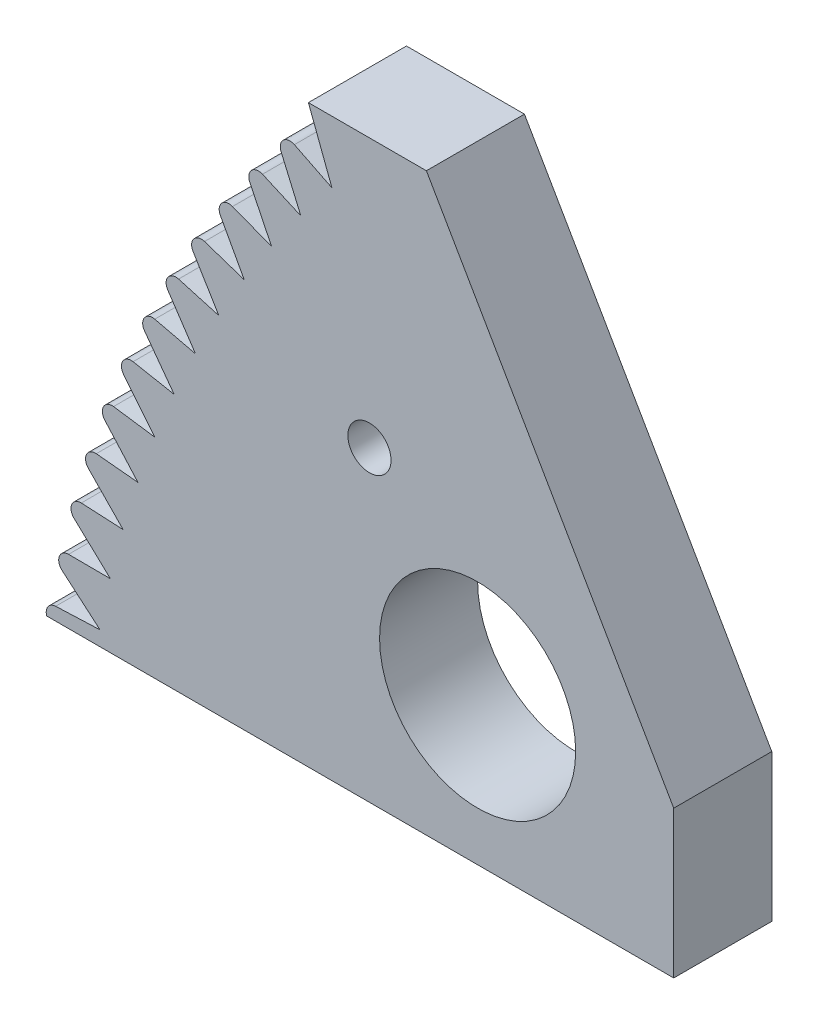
ISO-10303-21;
HEADER;
FILE_DESCRIPTION(('STEP AP214'),'2;1');
FILE_NAME('part.step','',(''),(''),'','','');
FILE_SCHEMA(('AUTOMOTIVE_DESIGN { 1 0 10303 214 1 1 1 1 }'));
ENDSEC;
DATA;
#1=APPLICATION_CONTEXT('core data for automotive mechanical design processes');
#2=APPLICATION_PROTOCOL_DEFINITION('international standard','automotive_design',2000,#1);
#3=PRODUCT_CONTEXT('',#1,'mechanical');
#4=PRODUCT('Part','Part','',(#3));
#5=PRODUCT_RELATED_PRODUCT_CATEGORY('part','',(#4));
#6=PRODUCT_DEFINITION_FORMATION('','',#4);
#7=PRODUCT_DEFINITION_CONTEXT('part definition',#1,'design');
#8=PRODUCT_DEFINITION('design','',#6,#7);
#9=PRODUCT_DEFINITION_SHAPE('','',#8);
#10=(LENGTH_UNIT() NAMED_UNIT(*) SI_UNIT(.MILLI.,.METRE.));
#11=(NAMED_UNIT(*) PLANE_ANGLE_UNIT() SI_UNIT($,.RADIAN.));
#12=(NAMED_UNIT(*) SI_UNIT($,.STERADIAN.) SOLID_ANGLE_UNIT());
#13=UNCERTAINTY_MEASURE_WITH_UNIT(LENGTH_MEASURE(1.E-05),#10,'distance_accuracy_value','');
#14=(GEOMETRIC_REPRESENTATION_CONTEXT(3) GLOBAL_UNCERTAINTY_ASSIGNED_CONTEXT((#13)) GLOBAL_UNIT_ASSIGNED_CONTEXT((#10,
#11,#12)) REPRESENTATION_CONTEXT('',''));
#15=CARTESIAN_POINT('',(0.,0.,0.));
#16=DIRECTION('',(0.,0.,1.));
#17=DIRECTION('',(1.,0.,0.));
#18=AXIS2_PLACEMENT_3D('',#15,#16,#17);
#19=CARTESIAN_POINT('',(-80.9362544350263,37.2735356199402,10.));
#20=DIRECTION('',(0.,0.,-1.));
#21=DIRECTION('',(-1.,0.,0.));
#22=AXIS2_PLACEMENT_3D('',#19,#20,#21);
#23=PLANE('',#22);
#24=CARTESIAN_POINT('',(-111.969374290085,9.89423995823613,10.));
#25=DIRECTION('',(0.,0.,-1.));
#26=DIRECTION('',(0.,1.,0.));
#27=AXIS2_PLACEMENT_3D('',#24,#25,#26);
#28=CIRCLE('',#27,2.2);
#29=CARTESIAN_POINT('',(-111.969374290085,12.0942399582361,10.));
#30=VERTEX_POINT('',#29);
#31=EDGE_CURVE('E1356',#30,#30,#28,.T.);
#32=ORIENTED_EDGE('',*,*,#31,.T.);
#33=EDGE_LOOP('',(#32));
#34=FACE_BOUND('',#33,.T.);
#35=DIRECTION('',(-0.999180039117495,-0.0404876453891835,0.));
#36=VECTOR('',#35,1.);
#37=CARTESIAN_POINT('',(-139.448047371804,-19.9190594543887,10.));
#38=LINE('',#37,#36);
#39=CARTESIAN_POINT('',(-139.448047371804,-19.9190594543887,10.));
#40=VERTEX_POINT('',#39);
#41=CARTESIAN_POINT('',(-143.976101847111,-20.1025401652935,10.));
#42=VERTEX_POINT('',#41);
#43=EDGE_CURVE('E767',#40,#42,#38,.T.);
#44=ORIENTED_EDGE('',*,*,#43,.T.);
#45=CARTESIAN_POINT('',(-143.935614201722,-21.101720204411,10.));
#46=DIRECTION('',(0.,0.,-1.));
#47=DIRECTION('',(-1.,0.,0.));
#48=AXIS2_PLACEMENT_3D('',#45,#46,#47);
#49=CIRCLE('',#48,1.);
#50=CARTESIAN_POINT('',(-144.884740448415,-21.4166160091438,10.));
#51=VERTEX_POINT('',#50);
#52=EDGE_CURVE('E862',#42,#51,#49,.F.);
#53=ORIENTED_EDGE('',*,*,#52,.T.);
#54=DIRECTION('',(1.,0.,0.));
#55=VECTOR('',#54,1.);
#56=CARTESIAN_POINT('',(-80.9362544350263,-21.4166160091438,10.));
#57=LINE('',#56,#55);
#58=CARTESIAN_POINT('',(-80.9362544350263,-21.4166160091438,10.));
#59=VERTEX_POINT('',#58);
#60=EDGE_CURVE('E770',#51,#59,#57,.T.);
#61=ORIENTED_EDGE('',*,*,#60,.T.);
#62=DIRECTION('',(0.,1.,0.));
#63=VECTOR('',#62,1.);
#64=CARTESIAN_POINT('',(-80.9362544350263,-21.4166160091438,10.));
#65=LINE('',#64,#63);
#66=CARTESIAN_POINT('',(-80.9362544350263,-6.41661600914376,10.));
#67=VERTEX_POINT('',#66);
#68=EDGE_CURVE('E706',#59,#67,#65,.T.);
#69=ORIENTED_EDGE('',*,*,#68,.T.);
#70=DIRECTION('',(-0.499999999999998,0.86602540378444,0.));
#71=VECTOR('',#70,1.);
#72=CARTESIAN_POINT('',(-80.9362544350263,-6.41661600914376,10.));
#73=LINE('',#72,#71);
#74=CARTESIAN_POINT('',(-106.160775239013,37.2735356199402,10.));
#75=VERTEX_POINT('',#74);
#76=EDGE_CURVE('E627',#67,#75,#73,.T.);
#77=ORIENTED_EDGE('',*,*,#76,.T.);
#78=DIRECTION('',(-1.,0.,0.));
#79=VECTOR('',#78,1.);
#80=CARTESIAN_POINT('',(-118.19600716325,37.2735356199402,10.));
#81=LINE('',#80,#79);
#82=CARTESIAN_POINT('',(-118.19600716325,37.2735356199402,10.));
#83=VERTEX_POINT('',#82);
#84=EDGE_CURVE('E709',#75,#83,#81,.T.);
#85=ORIENTED_EDGE('',*,*,#84,.T.);
#86=DIRECTION('',(0.354748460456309,-0.93496177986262,0.));
#87=VECTOR('',#86,1.);
#88=CARTESIAN_POINT('',(-118.19600716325,37.2735356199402,10.));
#89=LINE('',#88,#87);
#90=CARTESIAN_POINT('',(-115.796030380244,30.9482465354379,10.));
#91=VERTEX_POINT('',#90);
#92=EDGE_CURVE('E711',#83,#91,#89,.T.);
#93=ORIENTED_EDGE('',*,*,#92,.T.);
#94=DIRECTION('',(-0.895940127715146,0.444174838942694,0.));
#95=VECTOR('',#94,1.);
#96=CARTESIAN_POINT('',(-115.796030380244,30.9482465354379,10.));
#97=LINE('',#96,#95);
#98=CARTESIAN_POINT('',(-119.622868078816,32.8454548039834,10.));
#99=VERTEX_POINT('',#98);
#100=EDGE_CURVE('E713',#91,#99,#97,.T.);
#101=ORIENTED_EDGE('',*,*,#100,.T.);
#102=CARTESIAN_POINT('',(-120.067042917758,31.9495146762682,10.));
#103=DIRECTION('',(0.,0.,-1.));
#104=DIRECTION('',(-1.,0.,0.));
#105=AXIS2_PLACEMENT_3D('',#102,#103,#104);
#106=CIRCLE('',#105,1.);
#107=CARTESIAN_POINT('',(-120.984892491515,31.5525862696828,10.));
#108=VERTEX_POINT('',#107);
#109=EDGE_CURVE('E841',#99,#108,#106,.F.);
#110=ORIENTED_EDGE('',*,*,#109,.T.);
#111=DIRECTION('',(0.396928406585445,-0.9178495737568,0.));
#112=VECTOR('',#111,1.);
#113=CARTESIAN_POINT('',(-122.068286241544,34.0578050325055,10.));
#114=LINE('',#113,#112);
#115=CARTESIAN_POINT('',(-118.967003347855,26.8864584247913,10.));
#116=VERTEX_POINT('',#115);
#117=EDGE_CURVE('E716',#108,#116,#114,.T.);
#118=ORIENTED_EDGE('',*,*,#117,.T.);
#119=DIRECTION('',(-0.91522508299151,0.402942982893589,0.));
#120=VECTOR('',#119,1.);
#121=CARTESIAN_POINT('',(-118.967003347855,26.8864584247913,10.));
#122=LINE('',#121,#120);
#123=CARTESIAN_POINT('',(-122.876213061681,28.6075526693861,10.));
#124=VERTEX_POINT('',#123);
#125=EDGE_CURVE('E718',#116,#124,#122,.T.);
#126=ORIENTED_EDGE('',*,*,#125,.T.);
#127=CARTESIAN_POINT('',(-123.279156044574,27.6923275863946,10.));
#128=DIRECTION('',(0.,0.,-1.));
#129=DIRECTION('',(-1.,0.,0.));
#130=AXIS2_PLACEMENT_3D('',#127,#128,#129);
#131=CIRCLE('',#130,1.);
#132=CARTESIAN_POINT('',(-124.177991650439,27.2540416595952,10.));
#133=VERTEX_POINT('',#132);
#134=EDGE_CURVE('E843',#124,#133,#131,.F.);
#135=ORIENTED_EDGE('',*,*,#134,.T.);
#136=DIRECTION('',(0.438285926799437,-0.898835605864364,0.));
#137=VECTOR('',#136,1.);
#138=CARTESIAN_POINT('',(-125.374268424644,29.7073628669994,10.));
#139=LINE('',#138,#137);
#140=CARTESIAN_POINT('',(-121.949850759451,22.6845762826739,10.));
#141=VERTEX_POINT('',#140);
#142=EDGE_CURVE('E721',#133,#141,#139,.T.);
#143=ORIENTED_EDGE('',*,*,#142,.T.);
#144=DIRECTION('',(-0.932613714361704,0.360876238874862,0.));
#145=VECTOR('',#144,1.);
#146=CARTESIAN_POINT('',(-121.949850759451,22.6845762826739,10.));
#147=LINE('',#146,#145);
#148=CARTESIAN_POINT('',(-125.933332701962,24.2259904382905,10.));
#149=VERTEX_POINT('',#148);
#150=EDGE_CURVE('E723',#141,#149,#147,.T.);
#151=ORIENTED_EDGE('',*,*,#150,.T.);
#152=CARTESIAN_POINT('',(-126.294208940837,23.2933767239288,10.));
#153=DIRECTION('',(0.,0.,-1.));
#154=DIRECTION('',(-1.,0.,0.));
#155=AXIS2_PLACEMENT_3D('',#152,#153,#154);
#156=CIRCLE('',#155,1.);
#157=CARTESIAN_POINT('',(-127.172168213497,22.8146413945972,10.));
#158=VERTEX_POINT('',#157);
#159=EDGE_CURVE('E845',#149,#158,#156,.F.);
#160=ORIENTED_EDGE('',*,*,#159,.T.);
#161=DIRECTION('',(0.478735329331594,-0.877959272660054,0.));
#162=VECTOR('',#161,1.);
#163=CARTESIAN_POINT('',(-128.478849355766,25.2109818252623,10.));
#164=LINE('',#163,#162);
#165=CARTESIAN_POINT('',(-124.738392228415,18.3513063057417,10.));
#166=VERTEX_POINT('',#165);
#167=EDGE_CURVE('E726',#158,#166,#164,.T.);
#168=ORIENTED_EDGE('',*,*,#167,.T.);
#169=DIRECTION('',(-0.94806999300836,0.318061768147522,0.));
#170=VECTOR('',#169,1.);
#171=CARTESIAN_POINT('',(-124.738392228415,18.3513063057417,10.));
#172=LINE('',#171,#170);
#173=CARTESIAN_POINT('',(-128.787892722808,19.7098466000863,10.));
#174=VERTEX_POINT('',#173);
#175=EDGE_CURVE('E728',#166,#174,#172,.T.);
#176=ORIENTED_EDGE('',*,*,#175,.T.);
#177=CARTESIAN_POINT('',(-129.105954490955,18.761776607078,10.));
#178=DIRECTION('',(0.,0.,-1.));
#179=DIRECTION('',(-1.,0.,0.));
#180=AXIS2_PLACEMENT_3D('',#177,#178,#179);
#181=CIRCLE('',#180,1.);
#182=CARTESIAN_POINT('',(-129.961218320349,18.2435838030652,10.));
#183=VERTEX_POINT('',#182);
#184=EDGE_CURVE('E847',#174,#183,#181,.F.);
#185=ORIENTED_EDGE('',*,*,#184,.T.);
#186=DIRECTION('',(0.518192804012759,-0.855263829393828,0.));
#187=VECTOR('',#186,1.);
#188=CARTESIAN_POINT('',(-131.37559641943,20.5779782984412,10.));
#189=LINE('',#188,#187);
#190=CARTESIAN_POINT('',(-127.326849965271,13.8956269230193,10.));
#191=VERTEX_POINT('',#190);
#192=EDGE_CURVE('E731',#183,#191,#189,.T.);
#193=ORIENTED_EDGE('',*,*,#192,.T.);
#194=DIRECTION('',(-0.961561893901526,0.274588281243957,0.));
#195=VECTOR('',#194,1.);
#196=CARTESIAN_POINT('',(-127.326849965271,13.8956269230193,10.));
#197=LINE('',#196,#195);
#198=CARTESIAN_POINT('',(-131.433978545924,15.0684784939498,10.));
#199=VERTEX_POINT('',#198);
#200=EDGE_CURVE('E733',#191,#199,#197,.T.);
#201=ORIENTED_EDGE('',*,*,#200,.T.);
#202=CARTESIAN_POINT('',(-131.708566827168,14.1069166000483,10.));
#203=DIRECTION('',(0.,0.,-1.));
#204=DIRECTION('',(-1.,0.,0.));
#205=AXIS2_PLACEMENT_3D('',#202,#203,#204);
#206=CIRCLE('',#205,1.);
#207=CARTESIAN_POINT('',(-132.539363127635,13.5503400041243,10.));
#208=VERTEX_POINT('',#207);
#209=EDGE_CURVE('E849',#199,#208,#206,.F.);
#210=ORIENTED_EDGE('',*,*,#209,.T.);
#211=DIRECTION('',(0.556576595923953,-0.83079630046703,0.));
#212=VECTOR('',#211,1.);
#213=CARTESIAN_POINT('',(-134.058507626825,15.8179517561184,10.));
#214=LINE('',#213,#212);
#215=CARTESIAN_POINT('',(-129.709860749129,9.32677019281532,10.));
#216=VERTEX_POINT('',#215);
#217=EDGE_CURVE('E736',#208,#216,#214,.T.);
#218=ORIENTED_EDGE('',*,*,#217,.T.);
#219=DIRECTION('',(-0.973061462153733,0.2305458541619,0.));
#220=VECTOR('',#219,1.);
#221=CARTESIAN_POINT('',(-129.709860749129,9.32677019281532,10.));
#222=LINE('',#221,#220);
#223=CARTESIAN_POINT('',(-133.866107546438,10.3115029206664,10.));
#224=VERTEX_POINT('',#223);
#225=EDGE_CURVE('E738',#216,#224,#222,.T.);
#226=ORIENTED_EDGE('',*,*,#225,.T.);
#227=CARTESIAN_POINT('',(-134.0966534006,9.33844145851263,10.));
#228=DIRECTION('',(0.,0.,-1.));
#229=DIRECTION('',(-1.,0.,0.));
#230=AXIS2_PLACEMENT_3D('',#227,#228,#229);
#231=CIRCLE('',#230,1.);
#232=CARTESIAN_POINT('',(-134.901260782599,8.74463428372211,10.));
#233=VERTEX_POINT('',#232);
#234=EDGE_CURVE('E851',#224,#233,#231,.F.);
#235=ORIENTED_EDGE('',*,*,#234,.T.);
#236=DIRECTION('',(0.593807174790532,-0.804607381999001,0.));
#237=VECTOR('',#236,1.);
#238=CARTESIAN_POINT('',(-136.522024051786,10.9407648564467,10.));
#239=LINE('',#238,#237);
#240=CARTESIAN_POINT('',(-131.882487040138,4.65420267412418,10.));
#241=VERTEX_POINT('',#240);
#242=EDGE_CURVE('E741',#233,#241,#239,.T.);
#243=ORIENTED_EDGE('',*,*,#242,.T.);
#244=DIRECTION('',(-0.982544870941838,0.186025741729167,0.));
#245=VECTOR('',#244,1.);
#246=CARTESIAN_POINT('',(-131.882487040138,4.65420267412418,10.));
#247=LINE('',#246,#245);
#248=CARTESIAN_POINT('',(-136.079240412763,5.44877621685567,10.));
#249=VERTEX_POINT('',#248);
#250=EDGE_CURVE('E743',#241,#249,#247,.T.);
#251=ORIENTED_EDGE('',*,*,#250,.T.);
#252=CARTESIAN_POINT('',(-136.265266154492,4.46623134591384,10.));
#253=DIRECTION('',(0.,0.,-1.));
#254=DIRECTION('',(-1.,0.,0.));
#255=AXIS2_PLACEMENT_3D('',#252,#253,#254);
#256=CIRCLE('',#255,1.);
#257=CARTESIAN_POINT('',(-137.042017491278,3.83642394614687,10.));
#258=VERTEX_POINT('',#257);
#259=EDGE_CURVE('E853',#249,#258,#256,.F.);
#260=ORIENTED_EDGE('',*,*,#259,.T.);
#261=DIRECTION('',(0.629807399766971,-0.776751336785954,0.));
#262=VECTOR('',#261,1.);
#263=CARTESIAN_POINT('',(-138.761041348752,5.95652301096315,10.));
#264=LINE('',#263,#262);
#265=CARTESIAN_POINT('',(-133.840227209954,-0.112394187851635,10.));
#266=VERTEX_POINT('',#265);
#267=EDGE_CURVE('E746',#258,#266,#264,.T.);
#268=ORIENTED_EDGE('',*,*,#267,.T.);
#269=DIRECTION('',(-0.98999247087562,0.141120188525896,0.));
#270=VECTOR('',#269,1.);
#271=CARTESIAN_POINT('',(-133.840227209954,-0.112394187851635,10.));
#272=LINE('',#271,#270);
#273=CARTESIAN_POINT('',(-138.068791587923,0.490373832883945,10.));
#274=VERTEX_POINT('',#273);
#275=EDGE_CURVE('E748',#266,#274,#272,.T.);
#276=ORIENTED_EDGE('',*,*,#275,.T.);
#277=CARTESIAN_POINT('',(-138.209911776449,-0.499618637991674,10.));
#278=DIRECTION('',(0.,0.,-1.));
#279=DIRECTION('',(-1.,0.,0.));
#280=AXIS2_PLACEMENT_3D('',#277,#278,#279);
#281=CIRCLE('',#280,1.);
#282=CARTESIAN_POINT('',(-138.957197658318,-1.16412131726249,10.));
#283=VERTEX_POINT('',#282);
#284=EDGE_CURVE('E855',#274,#283,#281,.F.);
#285=ORIENTED_EDGE('',*,*,#284,.T.);
#286=DIRECTION('',(0.664502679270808,-0.747285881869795,0.));
#287=VECTOR('',#286,1.);
#288=CARTESIAN_POINT('',(-140.770920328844,0.875553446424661,10.));
#289=LINE('',#288,#287);
#290=CARTESIAN_POINT('',(-135.579024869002,-4.9631441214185,10.));
#291=VERTEX_POINT('',#290);
#292=EDGE_CURVE('E751',#283,#291,#289,.T.);
#293=ORIENTED_EDGE('',*,*,#292,.T.);
#294=DIRECTION('',(-0.99538883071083,0.0959222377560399,0.));
#295=VECTOR('',#294,1.);
#296=CARTESIAN_POINT('',(-135.579024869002,-4.9631441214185,10.));
#297=LINE('',#296,#295);
#298=CARTESIAN_POINT('',(-139.830638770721,-4.55343054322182,10.));
#299=VERTEX_POINT('',#298);
#300=EDGE_CURVE('E753',#291,#299,#297,.T.);
#301=ORIENTED_EDGE('',*,*,#300,.T.);
#302=CARTESIAN_POINT('',(-139.926561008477,-5.54881937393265,10.));
#303=DIRECTION('',(0.,0.,-1.));
#304=DIRECTION('',(-1.,0.,0.));
#305=AXIS2_PLACEMENT_3D('',#302,#303,#304);
#306=CIRCLE('',#305,1.);
#307=CARTESIAN_POINT('',(-140.642833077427,-6.24664049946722,10.));
#308=VERTEX_POINT('',#307);
#309=EDGE_CURVE('E857',#299,#308,#306,.F.);
#310=ORIENTED_EDGE('',*,*,#309,.T.);
#311=DIRECTION('',(0.697821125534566,-0.716272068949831,0.));
#312=VECTOR('',#311,1.);
#313=CARTESIAN_POINT('',(-142.547496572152,-4.29161619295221,10.));
#314=LINE('',#313,#312);
#315=CARTESIAN_POINT('',(-137.095277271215,-9.88799649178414,10.));
#316=VERTEX_POINT('',#315);
#317=EDGE_CURVE('E756',#308,#316,#314,.T.);
#318=ORIENTED_EDGE('',*,*,#317,.T.);
#319=DIRECTION('',(-0.998722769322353,0.050525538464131,0.));
#320=VECTOR('',#319,1.);
#321=CARTESIAN_POINT('',(-137.095277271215,-9.88799649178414,10.));
#322=LINE('',#321,#320);
#323=CARTESIAN_POINT('',(-141.361131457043,-9.67218627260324,10.));
#324=VERTEX_POINT('',#323);
#325=EDGE_CURVE('E758',#316,#324,#322,.T.);
#326=ORIENTED_EDGE('',*,*,#325,.T.);
#327=CARTESIAN_POINT('',(-141.411656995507,-10.6709090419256,10.));
#328=DIRECTION('',(0.,0.,-1.));
#329=DIRECTION('',(-1.,0.,0.));
#330=AXIS2_PLACEMENT_3D('',#327,#328,#329);
#331=CIRCLE('',#330,1.);
#332=CARTESIAN_POINT('',(-142.095431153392,-11.400602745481,10.));
#333=VERTEX_POINT('',#332);
#334=EDGE_CURVE('E859',#324,#333,#331,.F.);
#335=ORIENTED_EDGE('',*,*,#334,.T.);
#336=DIRECTION('',(0.729693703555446,-0.683774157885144,0.));
#337=VECTOR('',#336,1.);
#338=CARTESIAN_POINT('',(-144.087089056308,-9.53427965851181,10.));
#339=LINE('',#338,#337);
#340=CARTESIAN_POINT('',(-138.385842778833,-14.8767471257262,10.));
#341=VERTEX_POINT('',#340);
#342=EDGE_CURVE('E761',#333,#341,#339,.T.);
#343=ORIENTED_EDGE('',*,*,#342,.T.);
#344=DIRECTION('',(-0.999987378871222,0.00502415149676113,0.));
#345=VECTOR('',#344,1.);
#346=CARTESIAN_POINT('',(-138.385842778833,-14.8767471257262,10.));
#347=LINE('',#346,#345);
#348=CARTESIAN_POINT('',(-142.657098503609,-14.8552874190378,10.));
#349=VERTEX_POINT('',#348);
#350=EDGE_CURVE('E763',#341,#349,#347,.T.);
#351=ORIENTED_EDGE('',*,*,#350,.T.);
#352=CARTESIAN_POINT('',(-142.662122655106,-15.855274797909,10.));
#353=DIRECTION('',(0.,0.,-1.));
#354=DIRECTION('',(-1.,0.,0.));
#355=AXIS2_PLACEMENT_3D('',#352,#353,#354);
#356=CIRCLE('',#355,1.);
#357=CARTESIAN_POINT('',(-143.311982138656,-16.6153291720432,10.));
#358=VERTEX_POINT('',#357);
#359=EDGE_CURVE('E368',#349,#358,#356,.F.);
#360=ORIENTED_EDGE('',*,*,#359,.T.);
#361=DIRECTION('',(0.760054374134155,-0.649859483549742,0.));
#362=VECTOR('',#361,1.);
#363=CARTESIAN_POINT('',(-145.386507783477,-14.8415742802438,10.));
#364=LINE('',#363,#362);
#365=EDGE_CURVE('E765',#358,#40,#364,.T.);
#366=ORIENTED_EDGE('',*,*,#365,.T.);
#367=EDGE_LOOP('',(#44,#53,#61,#69,#77,#85,#93,#101,#110,#118,#126,#135,#143,#151,#160,#168,
#176,#185,#193,#201,#210,#218,#226,#235,#243,#251,#260,#268,#276,#285,#293,#301,#310,#318,#326,
#335,#343,#351,#360,#366));
#368=FACE_BOUND('',#367,.T.);
#369=CARTESIAN_POINT('',(-100.936254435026,-6.41661600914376,10.));
#370=DIRECTION('',(0.,0.,1.));
#371=DIRECTION('',(1.,0.,0.));
#372=AXIS2_PLACEMENT_3D('',#369,#370,#371);
#373=CIRCLE('',#372,9.99999999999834);
#374=CARTESIAN_POINT('',(-90.9362544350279,-6.41661600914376,10.));
#375=VERTEX_POINT('',#374);
#376=EDGE_CURVE('E637',#375,#375,#373,.T.);
#377=ORIENTED_EDGE('',*,*,#376,.F.);
#378=EDGE_LOOP('',(#377));
#379=FACE_BOUND('',#378,.T.);
#380=ADVANCED_FACE('F353',(#34,#368,#379),#23,.F.);
#381=CARTESIAN_POINT('',(-80.9362544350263,37.2735356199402,0.));
#382=DIRECTION('',(0.,0.,-1.));
#383=DIRECTION('',(-1.,0.,0.));
#384=AXIS2_PLACEMENT_3D('',#381,#382,#383);
#385=PLANE('',#384);
#386=CARTESIAN_POINT('',(-111.969374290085,9.89423995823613,0.));
#387=DIRECTION('',(0.,0.,-1.));
#388=DIRECTION('',(0.,1.,0.));
#389=AXIS2_PLACEMENT_3D('',#386,#387,#388);
#390=CIRCLE('',#389,2.2);
#391=CARTESIAN_POINT('',(-111.969374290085,12.0942399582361,0.));
#392=VERTEX_POINT('',#391);
#393=EDGE_CURVE('E1357',#392,#392,#390,.T.);
#394=ORIENTED_EDGE('',*,*,#393,.F.);
#395=EDGE_LOOP('',(#394));
#396=FACE_BOUND('',#395,.T.);
#397=DIRECTION('',(1.,0.,0.));
#398=VECTOR('',#397,1.);
#399=CARTESIAN_POINT('',(-80.9362544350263,-21.4166160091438,0.));
#400=LINE('',#399,#398);
#401=CARTESIAN_POINT('',(-144.884740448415,-21.4166160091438,0.));
#402=VERTEX_POINT('',#401);
#403=CARTESIAN_POINT('',(-80.9362544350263,-21.4166160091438,0.));
#404=VERTEX_POINT('',#403);
#405=EDGE_CURVE('E704',#402,#404,#400,.T.);
#406=ORIENTED_EDGE('',*,*,#405,.F.);
#407=CARTESIAN_POINT('',(-143.935614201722,-21.101720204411,0.));
#408=DIRECTION('',(0.,0.,-1.));
#409=DIRECTION('',(-1.,0.,0.));
#410=AXIS2_PLACEMENT_3D('',#407,#408,#409);
#411=CIRCLE('',#410,1.);
#412=CARTESIAN_POINT('',(-143.976101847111,-20.1025401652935,0.));
#413=VERTEX_POINT('',#412);
#414=EDGE_CURVE('E837',#402,#413,#411,.T.);
#415=ORIENTED_EDGE('',*,*,#414,.T.);
#416=DIRECTION('',(-0.999180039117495,-0.0404876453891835,0.));
#417=VECTOR('',#416,1.);
#418=CARTESIAN_POINT('',(-139.448047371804,-19.9190594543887,0.));
#419=LINE('',#418,#417);
#420=CARTESIAN_POINT('',(-139.448047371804,-19.9190594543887,0.));
#421=VERTEX_POINT('',#420);
#422=EDGE_CURVE('E701',#421,#413,#419,.T.);
#423=ORIENTED_EDGE('',*,*,#422,.F.);
#424=DIRECTION('',(0.760054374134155,-0.649859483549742,0.));
#425=VECTOR('',#424,1.);
#426=CARTESIAN_POINT('',(-145.386507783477,-14.8415742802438,0.));
#427=LINE('',#426,#425);
#428=CARTESIAN_POINT('',(-143.311982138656,-16.6153291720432,0.));
#429=VERTEX_POINT('',#428);
#430=EDGE_CURVE('E699',#429,#421,#427,.T.);
#431=ORIENTED_EDGE('',*,*,#430,.F.);
#432=CARTESIAN_POINT('',(-142.662122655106,-15.855274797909,0.));
#433=DIRECTION('',(0.,0.,-1.));
#434=DIRECTION('',(-1.,0.,0.));
#435=AXIS2_PLACEMENT_3D('',#432,#433,#434);
#436=CIRCLE('',#435,1.);
#437=CARTESIAN_POINT('',(-142.657098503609,-14.8552874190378,0.));
#438=VERTEX_POINT('',#437);
#439=EDGE_CURVE('E835',#429,#438,#436,.T.);
#440=ORIENTED_EDGE('',*,*,#439,.T.);
#441=DIRECTION('',(-0.999987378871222,0.00502415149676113,0.));
#442=VECTOR('',#441,1.);
#443=CARTESIAN_POINT('',(-138.385842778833,-14.8767471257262,0.));
#444=LINE('',#443,#442);
#445=CARTESIAN_POINT('',(-138.385842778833,-14.8767471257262,0.));
#446=VERTEX_POINT('',#445);
#447=EDGE_CURVE('E697',#446,#438,#444,.T.);
#448=ORIENTED_EDGE('',*,*,#447,.F.);
#449=DIRECTION('',(0.729693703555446,-0.683774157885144,0.));
#450=VECTOR('',#449,1.);
#451=CARTESIAN_POINT('',(-144.087089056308,-9.53427965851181,0.));
#452=LINE('',#451,#450);
#453=CARTESIAN_POINT('',(-142.095431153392,-11.400602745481,0.));
#454=VERTEX_POINT('',#453);
#455=EDGE_CURVE('E695',#454,#446,#452,.T.);
#456=ORIENTED_EDGE('',*,*,#455,.F.);
#457=CARTESIAN_POINT('',(-141.411656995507,-10.6709090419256,0.));
#458=DIRECTION('',(0.,0.,-1.));
#459=DIRECTION('',(-1.,0.,0.));
#460=AXIS2_PLACEMENT_3D('',#457,#458,#459);
#461=CIRCLE('',#460,1.);
#462=CARTESIAN_POINT('',(-141.361131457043,-9.67218627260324,0.));
#463=VERTEX_POINT('',#462);
#464=EDGE_CURVE('E833',#454,#463,#461,.T.);
#465=ORIENTED_EDGE('',*,*,#464,.T.);
#466=DIRECTION('',(-0.998722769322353,0.050525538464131,0.));
#467=VECTOR('',#466,1.);
#468=CARTESIAN_POINT('',(-137.095277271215,-9.88799649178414,0.));
#469=LINE('',#468,#467);
#470=CARTESIAN_POINT('',(-137.095277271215,-9.88799649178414,0.));
#471=VERTEX_POINT('',#470);
#472=EDGE_CURVE('E692',#471,#463,#469,.T.);
#473=ORIENTED_EDGE('',*,*,#472,.F.);
#474=DIRECTION('',(0.697821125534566,-0.716272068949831,0.));
#475=VECTOR('',#474,1.);
#476=CARTESIAN_POINT('',(-142.547496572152,-4.29161619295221,0.));
#477=LINE('',#476,#475);
#478=CARTESIAN_POINT('',(-140.642833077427,-6.24664049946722,0.));
#479=VERTEX_POINT('',#478);
#480=EDGE_CURVE('E690',#479,#471,#477,.T.);
#481=ORIENTED_EDGE('',*,*,#480,.F.);
#482=CARTESIAN_POINT('',(-139.926561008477,-5.54881937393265,0.));
#483=DIRECTION('',(0.,0.,-1.));
#484=DIRECTION('',(-1.,0.,0.));
#485=AXIS2_PLACEMENT_3D('',#482,#483,#484);
#486=CIRCLE('',#485,1.);
#487=CARTESIAN_POINT('',(-139.830638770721,-4.55343054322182,0.));
#488=VERTEX_POINT('',#487);
#489=EDGE_CURVE('E831',#479,#488,#486,.T.);
#490=ORIENTED_EDGE('',*,*,#489,.T.);
#491=DIRECTION('',(-0.99538883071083,0.0959222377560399,0.));
#492=VECTOR('',#491,1.);
#493=CARTESIAN_POINT('',(-135.579024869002,-4.9631441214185,0.));
#494=LINE('',#493,#492);
#495=CARTESIAN_POINT('',(-135.579024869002,-4.9631441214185,0.));
#496=VERTEX_POINT('',#495);
#497=EDGE_CURVE('E687',#496,#488,#494,.T.);
#498=ORIENTED_EDGE('',*,*,#497,.F.);
#499=DIRECTION('',(0.664502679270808,-0.747285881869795,0.));
#500=VECTOR('',#499,1.);
#501=CARTESIAN_POINT('',(-140.770920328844,0.875553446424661,0.));
#502=LINE('',#501,#500);
#503=CARTESIAN_POINT('',(-138.957197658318,-1.16412131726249,0.));
#504=VERTEX_POINT('',#503);
#505=EDGE_CURVE('E685',#504,#496,#502,.T.);
#506=ORIENTED_EDGE('',*,*,#505,.F.);
#507=CARTESIAN_POINT('',(-138.209911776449,-0.499618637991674,0.));
#508=DIRECTION('',(0.,0.,-1.));
#509=DIRECTION('',(-1.,0.,0.));
#510=AXIS2_PLACEMENT_3D('',#507,#508,#509);
#511=CIRCLE('',#510,1.);
#512=CARTESIAN_POINT('',(-138.068791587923,0.490373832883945,0.));
#513=VERTEX_POINT('',#512);
#514=EDGE_CURVE('E829',#504,#513,#511,.T.);
#515=ORIENTED_EDGE('',*,*,#514,.T.);
#516=DIRECTION('',(-0.98999247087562,0.141120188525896,0.));
#517=VECTOR('',#516,1.);
#518=CARTESIAN_POINT('',(-133.840227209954,-0.112394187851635,0.));
#519=LINE('',#518,#517);
#520=CARTESIAN_POINT('',(-133.840227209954,-0.112394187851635,0.));
#521=VERTEX_POINT('',#520);
#522=EDGE_CURVE('E682',#521,#513,#519,.T.);
#523=ORIENTED_EDGE('',*,*,#522,.F.);
#524=DIRECTION('',(0.629807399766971,-0.776751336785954,0.));
#525=VECTOR('',#524,1.);
#526=CARTESIAN_POINT('',(-138.761041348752,5.95652301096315,0.));
#527=LINE('',#526,#525);
#528=CARTESIAN_POINT('',(-137.042017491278,3.83642394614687,0.));
#529=VERTEX_POINT('',#528);
#530=EDGE_CURVE('E680',#529,#521,#527,.T.);
#531=ORIENTED_EDGE('',*,*,#530,.F.);
#532=CARTESIAN_POINT('',(-136.265266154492,4.46623134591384,0.));
#533=DIRECTION('',(0.,0.,-1.));
#534=DIRECTION('',(-1.,0.,0.));
#535=AXIS2_PLACEMENT_3D('',#532,#533,#534);
#536=CIRCLE('',#535,1.);
#537=CARTESIAN_POINT('',(-136.079240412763,5.44877621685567,0.));
#538=VERTEX_POINT('',#537);
#539=EDGE_CURVE('E827',#529,#538,#536,.T.);
#540=ORIENTED_EDGE('',*,*,#539,.T.);
#541=DIRECTION('',(-0.982544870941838,0.186025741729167,0.));
#542=VECTOR('',#541,1.);
#543=CARTESIAN_POINT('',(-131.882487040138,4.65420267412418,0.));
#544=LINE('',#543,#542);
#545=CARTESIAN_POINT('',(-131.882487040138,4.65420267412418,0.));
#546=VERTEX_POINT('',#545);
#547=EDGE_CURVE('E677',#546,#538,#544,.T.);
#548=ORIENTED_EDGE('',*,*,#547,.F.);
#549=DIRECTION('',(0.593807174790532,-0.804607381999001,0.));
#550=VECTOR('',#549,1.);
#551=CARTESIAN_POINT('',(-136.522024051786,10.9407648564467,0.));
#552=LINE('',#551,#550);
#553=CARTESIAN_POINT('',(-134.901260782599,8.74463428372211,0.));
#554=VERTEX_POINT('',#553);
#555=EDGE_CURVE('E675',#554,#546,#552,.T.);
#556=ORIENTED_EDGE('',*,*,#555,.F.);
#557=CARTESIAN_POINT('',(-134.0966534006,9.33844145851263,0.));
#558=DIRECTION('',(0.,0.,-1.));
#559=DIRECTION('',(-1.,0.,0.));
#560=AXIS2_PLACEMENT_3D('',#557,#558,#559);
#561=CIRCLE('',#560,1.);
#562=CARTESIAN_POINT('',(-133.866107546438,10.3115029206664,0.));
#563=VERTEX_POINT('',#562);
#564=EDGE_CURVE('E825',#554,#563,#561,.T.);
#565=ORIENTED_EDGE('',*,*,#564,.T.);
#566=DIRECTION('',(-0.973061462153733,0.2305458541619,0.));
#567=VECTOR('',#566,1.);
#568=CARTESIAN_POINT('',(-129.709860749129,9.32677019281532,0.));
#569=LINE('',#568,#567);
#570=CARTESIAN_POINT('',(-129.709860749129,9.32677019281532,0.));
#571=VERTEX_POINT('',#570);
#572=EDGE_CURVE('E672',#571,#563,#569,.T.);
#573=ORIENTED_EDGE('',*,*,#572,.F.);
#574=DIRECTION('',(0.556576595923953,-0.83079630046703,0.));
#575=VECTOR('',#574,1.);
#576=CARTESIAN_POINT('',(-134.058507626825,15.8179517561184,0.));
#577=LINE('',#576,#575);
#578=CARTESIAN_POINT('',(-132.539363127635,13.5503400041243,0.));
#579=VERTEX_POINT('',#578);
#580=EDGE_CURVE('E670',#579,#571,#577,.T.);
#581=ORIENTED_EDGE('',*,*,#580,.F.);
#582=CARTESIAN_POINT('',(-131.708566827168,14.1069166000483,0.));
#583=DIRECTION('',(0.,0.,-1.));
#584=DIRECTION('',(-1.,0.,0.));
#585=AXIS2_PLACEMENT_3D('',#582,#583,#584);
#586=CIRCLE('',#585,1.);
#587=CARTESIAN_POINT('',(-131.433978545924,15.0684784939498,0.));
#588=VERTEX_POINT('',#587);
#589=EDGE_CURVE('E823',#579,#588,#586,.T.);
#590=ORIENTED_EDGE('',*,*,#589,.T.);
#591=DIRECTION('',(-0.961561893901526,0.274588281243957,0.));
#592=VECTOR('',#591,1.);
#593=CARTESIAN_POINT('',(-127.326849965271,13.8956269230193,0.));
#594=LINE('',#593,#592);
#595=CARTESIAN_POINT('',(-127.326849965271,13.8956269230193,0.));
#596=VERTEX_POINT('',#595);
#597=EDGE_CURVE('E667',#596,#588,#594,.T.);
#598=ORIENTED_EDGE('',*,*,#597,.F.);
#599=DIRECTION('',(0.518192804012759,-0.855263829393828,0.));
#600=VECTOR('',#599,1.);
#601=CARTESIAN_POINT('',(-131.37559641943,20.5779782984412,0.));
#602=LINE('',#601,#600);
#603=CARTESIAN_POINT('',(-129.961218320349,18.2435838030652,0.));
#604=VERTEX_POINT('',#603);
#605=EDGE_CURVE('E665',#604,#596,#602,.T.);
#606=ORIENTED_EDGE('',*,*,#605,.F.);
#607=CARTESIAN_POINT('',(-129.105954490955,18.761776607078,0.));
#608=DIRECTION('',(0.,0.,-1.));
#609=DIRECTION('',(-1.,0.,0.));
#610=AXIS2_PLACEMENT_3D('',#607,#608,#609);
#611=CIRCLE('',#610,1.);
#612=CARTESIAN_POINT('',(-128.787892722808,19.7098466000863,0.));
#613=VERTEX_POINT('',#612);
#614=EDGE_CURVE('E821',#604,#613,#611,.T.);
#615=ORIENTED_EDGE('',*,*,#614,.T.);
#616=DIRECTION('',(-0.94806999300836,0.318061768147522,0.));
#617=VECTOR('',#616,1.);
#618=CARTESIAN_POINT('',(-124.738392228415,18.3513063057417,0.));
#619=LINE('',#618,#617);
#620=CARTESIAN_POINT('',(-124.738392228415,18.3513063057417,0.));
#621=VERTEX_POINT('',#620);
#622=EDGE_CURVE('E662',#621,#613,#619,.T.);
#623=ORIENTED_EDGE('',*,*,#622,.F.);
#624=DIRECTION('',(0.478735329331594,-0.877959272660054,0.));
#625=VECTOR('',#624,1.);
#626=CARTESIAN_POINT('',(-128.478849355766,25.2109818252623,0.));
#627=LINE('',#626,#625);
#628=CARTESIAN_POINT('',(-127.172168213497,22.8146413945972,0.));
#629=VERTEX_POINT('',#628);
#630=EDGE_CURVE('E660',#629,#621,#627,.T.);
#631=ORIENTED_EDGE('',*,*,#630,.F.);
#632=CARTESIAN_POINT('',(-126.294208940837,23.2933767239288,0.));
#633=DIRECTION('',(0.,0.,-1.));
#634=DIRECTION('',(-1.,0.,0.));
#635=AXIS2_PLACEMENT_3D('',#632,#633,#634);
#636=CIRCLE('',#635,1.);
#637=CARTESIAN_POINT('',(-125.933332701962,24.2259904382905,0.));
#638=VERTEX_POINT('',#637);
#639=EDGE_CURVE('E819',#629,#638,#636,.T.);
#640=ORIENTED_EDGE('',*,*,#639,.T.);
#641=DIRECTION('',(-0.932613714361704,0.360876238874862,0.));
#642=VECTOR('',#641,1.);
#643=CARTESIAN_POINT('',(-121.949850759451,22.6845762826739,0.));
#644=LINE('',#643,#642);
#645=CARTESIAN_POINT('',(-121.949850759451,22.6845762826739,0.));
#646=VERTEX_POINT('',#645);
#647=EDGE_CURVE('E657',#646,#638,#644,.T.);
#648=ORIENTED_EDGE('',*,*,#647,.F.);
#649=DIRECTION('',(0.438285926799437,-0.898835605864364,0.));
#650=VECTOR('',#649,1.);
#651=CARTESIAN_POINT('',(-125.374268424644,29.7073628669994,0.));
#652=LINE('',#651,#650);
#653=CARTESIAN_POINT('',(-124.177991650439,27.2540416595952,0.));
#654=VERTEX_POINT('',#653);
#655=EDGE_CURVE('E655',#654,#646,#652,.T.);
#656=ORIENTED_EDGE('',*,*,#655,.F.);
#657=CARTESIAN_POINT('',(-123.279156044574,27.6923275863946,0.));
#658=DIRECTION('',(0.,0.,-1.));
#659=DIRECTION('',(-1.,0.,0.));
#660=AXIS2_PLACEMENT_3D('',#657,#658,#659);
#661=CIRCLE('',#660,1.);
#662=CARTESIAN_POINT('',(-122.876213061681,28.6075526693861,0.));
#663=VERTEX_POINT('',#662);
#664=EDGE_CURVE('E817',#654,#663,#661,.T.);
#665=ORIENTED_EDGE('',*,*,#664,.T.);
#666=DIRECTION('',(-0.91522508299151,0.402942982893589,0.));
#667=VECTOR('',#666,1.);
#668=CARTESIAN_POINT('',(-118.967003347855,26.8864584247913,0.));
#669=LINE('',#668,#667);
#670=CARTESIAN_POINT('',(-118.967003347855,26.8864584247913,0.));
#671=VERTEX_POINT('',#670);
#672=EDGE_CURVE('E652',#671,#663,#669,.T.);
#673=ORIENTED_EDGE('',*,*,#672,.F.);
#674=DIRECTION('',(0.396928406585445,-0.9178495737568,0.));
#675=VECTOR('',#674,1.);
#676=CARTESIAN_POINT('',(-122.068286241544,34.0578050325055,0.));
#677=LINE('',#676,#675);
#678=CARTESIAN_POINT('',(-120.984892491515,31.5525862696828,0.));
#679=VERTEX_POINT('',#678);
#680=EDGE_CURVE('E650',#679,#671,#677,.T.);
#681=ORIENTED_EDGE('',*,*,#680,.F.);
#682=CARTESIAN_POINT('',(-120.067042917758,31.9495146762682,0.));
#683=DIRECTION('',(0.,0.,-1.));
#684=DIRECTION('',(-1.,0.,0.));
#685=AXIS2_PLACEMENT_3D('',#682,#683,#684);
#686=CIRCLE('',#685,1.);
#687=CARTESIAN_POINT('',(-119.622868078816,32.8454548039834,0.));
#688=VERTEX_POINT('',#687);
#689=EDGE_CURVE('E631',#679,#688,#686,.T.);
#690=ORIENTED_EDGE('',*,*,#689,.T.);
#691=DIRECTION('',(-0.895940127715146,0.444174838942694,0.));
#692=VECTOR('',#691,1.);
#693=CARTESIAN_POINT('',(-115.796030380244,30.9482465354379,0.));
#694=LINE('',#693,#692);
#695=CARTESIAN_POINT('',(-115.796030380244,30.9482465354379,0.));
#696=VERTEX_POINT('',#695);
#697=EDGE_CURVE('E647',#696,#688,#694,.T.);
#698=ORIENTED_EDGE('',*,*,#697,.F.);
#699=DIRECTION('',(0.354748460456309,-0.93496177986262,0.));
#700=VECTOR('',#699,1.);
#701=CARTESIAN_POINT('',(-118.19600716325,37.2735356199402,0.));
#702=LINE('',#701,#700);
#703=CARTESIAN_POINT('',(-118.19600716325,37.2735356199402,0.));
#704=VERTEX_POINT('',#703);
#705=EDGE_CURVE('E645',#704,#696,#702,.T.);
#706=ORIENTED_EDGE('',*,*,#705,.F.);
#707=DIRECTION('',(-1.,0.,0.));
#708=VECTOR('',#707,1.);
#709=CARTESIAN_POINT('',(-118.19600716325,37.2735356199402,0.));
#710=LINE('',#709,#708);
#711=CARTESIAN_POINT('',(-106.160775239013,37.2735356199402,0.));
#712=VERTEX_POINT('',#711);
#713=EDGE_CURVE('E619',#712,#704,#710,.T.);
#714=ORIENTED_EDGE('',*,*,#713,.F.);
#715=DIRECTION('',(-0.499999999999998,0.86602540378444,0.));
#716=VECTOR('',#715,1.);
#717=CARTESIAN_POINT('',(-80.9362544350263,-6.41661600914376,0.));
#718=LINE('',#717,#716);
#719=CARTESIAN_POINT('',(-80.9362544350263,-6.41661600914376,0.));
#720=VERTEX_POINT('',#719);
#721=EDGE_CURVE('E611',#720,#712,#718,.T.);
#722=ORIENTED_EDGE('',*,*,#721,.F.);
#723=DIRECTION('',(0.,1.,0.));
#724=VECTOR('',#723,1.);
#725=CARTESIAN_POINT('',(-80.9362544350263,-21.4166160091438,0.));
#726=LINE('',#725,#724);
#727=EDGE_CURVE('E617',#404,#720,#726,.T.);
#728=ORIENTED_EDGE('',*,*,#727,.F.);
#729=EDGE_LOOP('',(#406,#415,#423,#431,#440,#448,#456,#465,#473,#481,#490,#498,#506,#515,#523,
#531,#540,#548,#556,#565,#573,#581,#590,#598,#606,#615,#623,#631,#640,#648,#656,#665,#673,#681,
#690,#698,#706,#714,#722,#728));
#730=FACE_BOUND('',#729,.T.);
#731=CARTESIAN_POINT('',(-100.936254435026,-6.41661600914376,0.));
#732=DIRECTION('',(0.,0.,1.));
#733=DIRECTION('',(1.,0.,0.));
#734=AXIS2_PLACEMENT_3D('',#731,#732,#733);
#735=CIRCLE('',#734,9.99999999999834);
#736=CARTESIAN_POINT('',(-90.9362544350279,-6.41661600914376,0.));
#737=VERTEX_POINT('',#736);
#738=EDGE_CURVE('E640',#737,#737,#735,.T.);
#739=ORIENTED_EDGE('',*,*,#738,.T.);
#740=EDGE_LOOP('',(#739));
#741=FACE_BOUND('',#740,.T.);
#742=ADVANCED_FACE('F614',(#396,#730,#741),#385,.T.);
#743=CARTESIAN_POINT('',(-80.9362544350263,-21.4166160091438,10.));
#744=DIRECTION('',(-1.,0.,0.));
#745=DIRECTION('',(0.,-1.,0.));
#746=AXIS2_PLACEMENT_3D('',#743,#744,#745);
#747=PLANE('',#746);
#748=ORIENTED_EDGE('',*,*,#727,.T.);
#749=DIRECTION('',(0.,0.,-1.));
#750=VECTOR('',#749,1.);
#751=CARTESIAN_POINT('',(-80.9362544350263,-6.41661600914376,10.));
#752=LINE('',#751,#750);
#753=EDGE_CURVE('E625',#67,#720,#752,.T.);
#754=ORIENTED_EDGE('',*,*,#753,.F.);
#755=ORIENTED_EDGE('',*,*,#68,.F.);
#756=DIRECTION('',(0.,0.,-1.));
#757=VECTOR('',#756,1.);
#758=CARTESIAN_POINT('',(-80.9362544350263,-21.4166160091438,10.));
#759=LINE('',#758,#757);
#760=EDGE_CURVE('E636',#59,#404,#759,.T.);
#761=ORIENTED_EDGE('',*,*,#760,.T.);
#762=EDGE_LOOP('',(#748,#754,#755,#761));
#763=FACE_BOUND('',#762,.T.);
#764=ADVANCED_FACE('F355',(#763),#747,.F.);
#765=CARTESIAN_POINT('',(-80.9362544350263,-6.41661600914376,10.));
#766=DIRECTION('',(-0.86602540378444,-0.499999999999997,0.));
#767=DIRECTION('',(0.499999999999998,-0.86602540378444,0.));
#768=AXIS2_PLACEMENT_3D('',#765,#766,#767);
#769=PLANE('',#768);
#770=ORIENTED_EDGE('',*,*,#721,.T.);
#771=DIRECTION('',(0.,0.,-1.));
#772=VECTOR('',#771,1.);
#773=CARTESIAN_POINT('',(-106.160775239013,37.2735356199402,10.));
#774=LINE('',#773,#772);
#775=EDGE_CURVE('E632',#75,#712,#774,.T.);
#776=ORIENTED_EDGE('',*,*,#775,.F.);
#777=ORIENTED_EDGE('',*,*,#76,.F.);
#778=ORIENTED_EDGE('',*,*,#753,.T.);
#779=EDGE_LOOP('',(#770,#776,#777,#778));
#780=FACE_BOUND('',#779,.T.);
#781=ADVANCED_FACE('F626',(#780),#769,.F.);
#782=CARTESIAN_POINT('',(-118.19600716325,37.2735356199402,10.));
#783=DIRECTION('',(0.,-1.,0.));
#784=DIRECTION('',(1.,0.,0.));
#785=AXIS2_PLACEMENT_3D('',#782,#783,#784);
#786=PLANE('',#785);
#787=ORIENTED_EDGE('',*,*,#713,.T.);
#788=DIRECTION('',(0.,0.,-1.));
#789=VECTOR('',#788,1.);
#790=CARTESIAN_POINT('',(-118.19600716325,37.2735356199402,10.));
#791=LINE('',#790,#789);
#792=EDGE_CURVE('E812',#83,#704,#791,.T.);
#793=ORIENTED_EDGE('',*,*,#792,.F.);
#794=ORIENTED_EDGE('',*,*,#84,.F.);
#795=ORIENTED_EDGE('',*,*,#775,.T.);
#796=EDGE_LOOP('',(#787,#793,#794,#795));
#797=FACE_BOUND('',#796,.T.);
#798=ADVANCED_FACE('F1073',(#797),#786,.F.);
#799=CARTESIAN_POINT('',(-118.19600716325,37.2735356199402,10.));
#800=DIRECTION('',(0.93496177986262,0.354748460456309,0.));
#801=DIRECTION('',(-0.354748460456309,0.93496177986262,0.));
#802=AXIS2_PLACEMENT_3D('',#799,#800,#801);
#803=PLANE('',#802);
#804=ORIENTED_EDGE('',*,*,#705,.T.);
#805=DIRECTION('',(0.,0.,-1.));
#806=VECTOR('',#805,1.);
#807=CARTESIAN_POINT('',(-115.796030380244,30.9482465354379,10.));
#808=LINE('',#807,#806);
#809=EDGE_CURVE('E809',#91,#696,#808,.T.);
#810=ORIENTED_EDGE('',*,*,#809,.F.);
#811=ORIENTED_EDGE('',*,*,#92,.F.);
#812=ORIENTED_EDGE('',*,*,#792,.T.);
#813=EDGE_LOOP('',(#804,#810,#811,#812));
#814=FACE_BOUND('',#813,.T.);
#815=ADVANCED_FACE('F1077',(#814),#803,.F.);
#816=CARTESIAN_POINT('',(-115.796030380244,30.9482465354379,10.));
#817=DIRECTION('',(-0.444174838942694,-0.895940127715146,0.));
#818=DIRECTION('',(0.895940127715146,-0.444174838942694,0.));
#819=AXIS2_PLACEMENT_3D('',#816,#817,#818);
#820=PLANE('',#819);
#821=ORIENTED_EDGE('',*,*,#697,.T.);
#822=DIRECTION('',(0.,0.,-1.));
#823=VECTOR('',#822,1.);
#824=CARTESIAN_POINT('',(-119.622868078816,32.8454548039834,10.));
#825=LINE('',#824,#823);
#826=EDGE_CURVE('E11',#688,#99,#825,.F.);
#827=ORIENTED_EDGE('',*,*,#826,.T.);
#828=ORIENTED_EDGE('',*,*,#100,.F.);
#829=ORIENTED_EDGE('',*,*,#809,.T.);
#830=EDGE_LOOP('',(#821,#827,#828,#829));
#831=FACE_BOUND('',#830,.T.);
#832=ADVANCED_FACE('F1082',(#831),#820,.F.);
#833=CARTESIAN_POINT('',(-122.068286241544,34.0578050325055,10.));
#834=DIRECTION('',(0.9178495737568,0.396928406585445,0.));
#835=DIRECTION('',(-0.396928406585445,0.9178495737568,0.));
#836=AXIS2_PLACEMENT_3D('',#833,#834,#835);
#837=PLANE('',#836);
#838=ORIENTED_EDGE('',*,*,#117,.F.);
#839=DIRECTION('',(0.,0.,-1.));
#840=VECTOR('',#839,1.);
#841=CARTESIAN_POINT('',(-120.984892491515,31.5525862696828,10.));
#842=LINE('',#841,#840);
#843=EDGE_CURVE('E361',#108,#679,#842,.T.);
#844=ORIENTED_EDGE('',*,*,#843,.T.);
#845=ORIENTED_EDGE('',*,*,#680,.T.);
#846=DIRECTION('',(0.,0.,-1.));
#847=VECTOR('',#846,1.);
#848=CARTESIAN_POINT('',(-118.967003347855,26.8864584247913,10.));
#849=LINE('',#848,#847);
#850=EDGE_CURVE('E806',#116,#671,#849,.T.);
#851=ORIENTED_EDGE('',*,*,#850,.F.);
#852=EDGE_LOOP('',(#838,#844,#845,#851));
#853=FACE_BOUND('',#852,.T.);
#854=ADVANCED_FACE('F917',(#853),#837,.F.);
#855=CARTESIAN_POINT('',(-118.967003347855,26.8864584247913,10.));
#856=DIRECTION('',(-0.402942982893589,-0.91522508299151,0.));
#857=DIRECTION('',(0.91522508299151,-0.402942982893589,0.));
#858=AXIS2_PLACEMENT_3D('',#855,#856,#857);
#859=PLANE('',#858);
#860=ORIENTED_EDGE('',*,*,#672,.T.);
#861=DIRECTION('',(0.,0.,-1.));
#862=VECTOR('',#861,1.);
#863=CARTESIAN_POINT('',(-122.876213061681,28.6075526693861,10.));
#864=LINE('',#863,#862);
#865=EDGE_CURVE('E911',#663,#124,#864,.F.);
#866=ORIENTED_EDGE('',*,*,#865,.T.);
#867=ORIENTED_EDGE('',*,*,#125,.F.);
#868=ORIENTED_EDGE('',*,*,#850,.T.);
#869=EDGE_LOOP('',(#860,#866,#867,#868));
#870=FACE_BOUND('',#869,.T.);
#871=ADVANCED_FACE('F926',(#870),#859,.F.);
#872=CARTESIAN_POINT('',(-125.374268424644,29.7073628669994,10.));
#873=DIRECTION('',(0.898835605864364,0.438285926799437,0.));
#874=DIRECTION('',(-0.438285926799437,0.898835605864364,0.));
#875=AXIS2_PLACEMENT_3D('',#872,#873,#874);
#876=PLANE('',#875);
#877=ORIENTED_EDGE('',*,*,#142,.F.);
#878=DIRECTION('',(0.,0.,-1.));
#879=VECTOR('',#878,1.);
#880=CARTESIAN_POINT('',(-124.177991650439,27.2540416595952,10.));
#881=LINE('',#880,#879);
#882=EDGE_CURVE('E908',#133,#654,#881,.T.);
#883=ORIENTED_EDGE('',*,*,#882,.T.);
#884=ORIENTED_EDGE('',*,*,#655,.T.);
#885=DIRECTION('',(0.,0.,-1.));
#886=VECTOR('',#885,1.);
#887=CARTESIAN_POINT('',(-121.949850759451,22.6845762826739,10.));
#888=LINE('',#887,#886);
#889=EDGE_CURVE('E803',#141,#646,#888,.T.);
#890=ORIENTED_EDGE('',*,*,#889,.F.);
#891=EDGE_LOOP('',(#877,#883,#884,#890));
#892=FACE_BOUND('',#891,.T.);
#893=ADVANCED_FACE('F936',(#892),#876,.F.);
#894=CARTESIAN_POINT('',(-121.949850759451,22.6845762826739,10.));
#895=DIRECTION('',(-0.360876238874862,-0.932613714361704,0.));
#896=DIRECTION('',(0.932613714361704,-0.360876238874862,0.));
#897=AXIS2_PLACEMENT_3D('',#894,#895,#896);
#898=PLANE('',#897);
#899=ORIENTED_EDGE('',*,*,#647,.T.);
#900=DIRECTION('',(0.,0.,-1.));
#901=VECTOR('',#900,1.);
#902=CARTESIAN_POINT('',(-125.933332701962,24.2259904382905,10.));
#903=LINE('',#902,#901);
#904=EDGE_CURVE('E906',#638,#149,#903,.F.);
#905=ORIENTED_EDGE('',*,*,#904,.T.);
#906=ORIENTED_EDGE('',*,*,#150,.F.);
#907=ORIENTED_EDGE('',*,*,#889,.T.);
#908=EDGE_LOOP('',(#899,#905,#906,#907));
#909=FACE_BOUND('',#908,.T.);
#910=ADVANCED_FACE('F940',(#909),#898,.F.);
#911=CARTESIAN_POINT('',(-128.478849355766,25.2109818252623,10.));
#912=DIRECTION('',(0.877959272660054,0.478735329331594,0.));
#913=DIRECTION('',(-0.478735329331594,0.877959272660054,0.));
#914=AXIS2_PLACEMENT_3D('',#911,#912,#913);
#915=PLANE('',#914);
#916=ORIENTED_EDGE('',*,*,#167,.F.);
#917=DIRECTION('',(0.,0.,-1.));
#918=VECTOR('',#917,1.);
#919=CARTESIAN_POINT('',(-127.172168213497,22.8146413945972,10.));
#920=LINE('',#919,#918);
#921=EDGE_CURVE('E903',#158,#629,#920,.T.);
#922=ORIENTED_EDGE('',*,*,#921,.T.);
#923=ORIENTED_EDGE('',*,*,#630,.T.);
#924=DIRECTION('',(0.,0.,-1.));
#925=VECTOR('',#924,1.);
#926=CARTESIAN_POINT('',(-124.738392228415,18.3513063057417,10.));
#927=LINE('',#926,#925);
#928=EDGE_CURVE('E800',#166,#621,#927,.T.);
#929=ORIENTED_EDGE('',*,*,#928,.F.);
#930=EDGE_LOOP('',(#916,#922,#923,#929));
#931=FACE_BOUND('',#930,.T.);
#932=ADVANCED_FACE('F949',(#931),#915,.F.);
#933=CARTESIAN_POINT('',(-124.738392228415,18.3513063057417,10.));
#934=DIRECTION('',(-0.318061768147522,-0.94806999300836,0.));
#935=DIRECTION('',(0.94806999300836,-0.318061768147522,0.));
#936=AXIS2_PLACEMENT_3D('',#933,#934,#935);
#937=PLANE('',#936);
#938=ORIENTED_EDGE('',*,*,#622,.T.);
#939=DIRECTION('',(0.,0.,-1.));
#940=VECTOR('',#939,1.);
#941=CARTESIAN_POINT('',(-128.787892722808,19.7098466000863,10.));
#942=LINE('',#941,#940);
#943=EDGE_CURVE('E901',#613,#174,#942,.F.);
#944=ORIENTED_EDGE('',*,*,#943,.T.);
#945=ORIENTED_EDGE('',*,*,#175,.F.);
#946=ORIENTED_EDGE('',*,*,#928,.T.);
#947=EDGE_LOOP('',(#938,#944,#945,#946));
#948=FACE_BOUND('',#947,.T.);
#949=ADVANCED_FACE('F955',(#948),#937,.F.);
#950=CARTESIAN_POINT('',(-131.37559641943,20.5779782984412,10.));
#951=DIRECTION('',(0.855263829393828,0.518192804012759,0.));
#952=DIRECTION('',(-0.518192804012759,0.855263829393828,0.));
#953=AXIS2_PLACEMENT_3D('',#950,#951,#952);
#954=PLANE('',#953);
#955=ORIENTED_EDGE('',*,*,#192,.F.);
#956=DIRECTION('',(0.,0.,-1.));
#957=VECTOR('',#956,1.);
#958=CARTESIAN_POINT('',(-129.961218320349,18.2435838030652,10.));
#959=LINE('',#958,#957);
#960=EDGE_CURVE('E898',#183,#604,#959,.T.);
#961=ORIENTED_EDGE('',*,*,#960,.T.);
#962=ORIENTED_EDGE('',*,*,#605,.T.);
#963=DIRECTION('',(0.,0.,-1.));
#964=VECTOR('',#963,1.);
#965=CARTESIAN_POINT('',(-127.326849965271,13.8956269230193,10.));
#966=LINE('',#965,#964);
#967=EDGE_CURVE('E797',#191,#596,#966,.T.);
#968=ORIENTED_EDGE('',*,*,#967,.F.);
#969=EDGE_LOOP('',(#955,#961,#962,#968));
#970=FACE_BOUND('',#969,.T.);
#971=ADVANCED_FACE('F964',(#970),#954,.F.);
#972=CARTESIAN_POINT('',(-127.326849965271,13.8956269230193,10.));
#973=DIRECTION('',(-0.274588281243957,-0.961561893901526,0.));
#974=DIRECTION('',(0.961561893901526,-0.274588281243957,0.));
#975=AXIS2_PLACEMENT_3D('',#972,#973,#974);
#976=PLANE('',#975);
#977=ORIENTED_EDGE('',*,*,#597,.T.);
#978=DIRECTION('',(0.,0.,-1.));
#979=VECTOR('',#978,1.);
#980=CARTESIAN_POINT('',(-131.433978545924,15.0684784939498,10.));
#981=LINE('',#980,#979);
#982=EDGE_CURVE('E896',#588,#199,#981,.F.);
#983=ORIENTED_EDGE('',*,*,#982,.T.);
#984=ORIENTED_EDGE('',*,*,#200,.F.);
#985=ORIENTED_EDGE('',*,*,#967,.T.);
#986=EDGE_LOOP('',(#977,#983,#984,#985));
#987=FACE_BOUND('',#986,.T.);
#988=ADVANCED_FACE('F968',(#987),#976,.F.);
#989=CARTESIAN_POINT('',(-134.058507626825,15.8179517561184,10.));
#990=DIRECTION('',(0.83079630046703,0.556576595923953,0.));
#991=DIRECTION('',(-0.556576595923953,0.83079630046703,0.));
#992=AXIS2_PLACEMENT_3D('',#989,#990,#991);
#993=PLANE('',#992);
#994=ORIENTED_EDGE('',*,*,#217,.F.);
#995=DIRECTION('',(0.,0.,-1.));
#996=VECTOR('',#995,1.);
#997=CARTESIAN_POINT('',(-132.539363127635,13.5503400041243,10.));
#998=LINE('',#997,#996);
#999=EDGE_CURVE('E893',#208,#579,#998,.T.);
#1000=ORIENTED_EDGE('',*,*,#999,.T.);
#1001=ORIENTED_EDGE('',*,*,#580,.T.);
#1002=DIRECTION('',(0.,0.,-1.));
#1003=VECTOR('',#1002,1.);
#1004=CARTESIAN_POINT('',(-129.709860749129,9.32677019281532,10.));
#1005=LINE('',#1004,#1003);
#1006=EDGE_CURVE('E794',#216,#571,#1005,.T.);
#1007=ORIENTED_EDGE('',*,*,#1006,.F.);
#1008=EDGE_LOOP('',(#994,#1000,#1001,#1007));
#1009=FACE_BOUND('',#1008,.T.);
#1010=ADVANCED_FACE('F977',(#1009),#993,.F.);
#1011=CARTESIAN_POINT('',(-129.709860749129,9.32677019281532,10.));
#1012=DIRECTION('',(-0.2305458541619,-0.973061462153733,0.));
#1013=DIRECTION('',(0.973061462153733,-0.2305458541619,0.));
#1014=AXIS2_PLACEMENT_3D('',#1011,#1012,#1013);
#1015=PLANE('',#1014);
#1016=ORIENTED_EDGE('',*,*,#572,.T.);
#1017=DIRECTION('',(0.,0.,-1.));
#1018=VECTOR('',#1017,1.);
#1019=CARTESIAN_POINT('',(-133.866107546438,10.3115029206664,10.));
#1020=LINE('',#1019,#1018);
#1021=EDGE_CURVE('E891',#563,#224,#1020,.F.);
#1022=ORIENTED_EDGE('',*,*,#1021,.T.);
#1023=ORIENTED_EDGE('',*,*,#225,.F.);
#1024=ORIENTED_EDGE('',*,*,#1006,.T.);
#1025=EDGE_LOOP('',(#1016,#1022,#1023,#1024));
#1026=FACE_BOUND('',#1025,.T.);
#1027=ADVANCED_FACE('F983',(#1026),#1015,.F.);
#1028=CARTESIAN_POINT('',(-136.522024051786,10.9407648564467,10.));
#1029=DIRECTION('',(0.804607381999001,0.593807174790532,0.));
#1030=DIRECTION('',(-0.593807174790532,0.804607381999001,0.));
#1031=AXIS2_PLACEMENT_3D('',#1028,#1029,#1030);
#1032=PLANE('',#1031);
#1033=ORIENTED_EDGE('',*,*,#242,.F.);
#1034=DIRECTION('',(0.,0.,-1.));
#1035=VECTOR('',#1034,1.);
#1036=CARTESIAN_POINT('',(-134.901260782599,8.74463428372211,10.));
#1037=LINE('',#1036,#1035);
#1038=EDGE_CURVE('E888',#233,#554,#1037,.T.);
#1039=ORIENTED_EDGE('',*,*,#1038,.T.);
#1040=ORIENTED_EDGE('',*,*,#555,.T.);
#1041=DIRECTION('',(0.,0.,-1.));
#1042=VECTOR('',#1041,1.);
#1043=CARTESIAN_POINT('',(-131.882487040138,4.65420267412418,10.));
#1044=LINE('',#1043,#1042);
#1045=EDGE_CURVE('E791',#241,#546,#1044,.T.);
#1046=ORIENTED_EDGE('',*,*,#1045,.F.);
#1047=EDGE_LOOP('',(#1033,#1039,#1040,#1046));
#1048=FACE_BOUND('',#1047,.T.);
#1049=ADVANCED_FACE('F992',(#1048),#1032,.F.);
#1050=CARTESIAN_POINT('',(-131.882487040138,4.65420267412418,10.));
#1051=DIRECTION('',(-0.186025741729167,-0.982544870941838,0.));
#1052=DIRECTION('',(0.982544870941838,-0.186025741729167,0.));
#1053=AXIS2_PLACEMENT_3D('',#1050,#1051,#1052);
#1054=PLANE('',#1053);
#1055=ORIENTED_EDGE('',*,*,#547,.T.);
#1056=DIRECTION('',(0.,0.,-1.));
#1057=VECTOR('',#1056,1.);
#1058=CARTESIAN_POINT('',(-136.079240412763,5.44877621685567,10.));
#1059=LINE('',#1058,#1057);
#1060=EDGE_CURVE('E886',#538,#249,#1059,.F.);
#1061=ORIENTED_EDGE('',*,*,#1060,.T.);
#1062=ORIENTED_EDGE('',*,*,#250,.F.);
#1063=ORIENTED_EDGE('',*,*,#1045,.T.);
#1064=EDGE_LOOP('',(#1055,#1061,#1062,#1063));
#1065=FACE_BOUND('',#1064,.T.);
#1066=ADVANCED_FACE('F996',(#1065),#1054,.F.);
#1067=CARTESIAN_POINT('',(-138.761041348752,5.95652301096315,10.));
#1068=DIRECTION('',(0.776751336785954,0.629807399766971,0.));
#1069=DIRECTION('',(-0.629807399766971,0.776751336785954,0.));
#1070=AXIS2_PLACEMENT_3D('',#1067,#1068,#1069);
#1071=PLANE('',#1070);
#1072=ORIENTED_EDGE('',*,*,#267,.F.);
#1073=DIRECTION('',(0.,0.,-1.));
#1074=VECTOR('',#1073,1.);
#1075=CARTESIAN_POINT('',(-137.042017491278,3.83642394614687,10.));
#1076=LINE('',#1075,#1074);
#1077=EDGE_CURVE('E883',#258,#529,#1076,.T.);
#1078=ORIENTED_EDGE('',*,*,#1077,.T.);
#1079=ORIENTED_EDGE('',*,*,#530,.T.);
#1080=DIRECTION('',(0.,0.,-1.));
#1081=VECTOR('',#1080,1.);
#1082=CARTESIAN_POINT('',(-133.840227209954,-0.112394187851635,10.));
#1083=LINE('',#1082,#1081);
#1084=EDGE_CURVE('E788',#266,#521,#1083,.T.);
#1085=ORIENTED_EDGE('',*,*,#1084,.F.);
#1086=EDGE_LOOP('',(#1072,#1078,#1079,#1085));
#1087=FACE_BOUND('',#1086,.T.);
#1088=ADVANCED_FACE('F1005',(#1087),#1071,.F.);
#1089=CARTESIAN_POINT('',(-133.840227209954,-0.112394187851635,10.));
#1090=DIRECTION('',(-0.141120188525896,-0.98999247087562,0.));
#1091=DIRECTION('',(0.98999247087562,-0.141120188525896,0.));
#1092=AXIS2_PLACEMENT_3D('',#1089,#1090,#1091);
#1093=PLANE('',#1092);
#1094=ORIENTED_EDGE('',*,*,#522,.T.);
#1095=DIRECTION('',(0.,0.,-1.));
#1096=VECTOR('',#1095,1.);
#1097=CARTESIAN_POINT('',(-138.068791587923,0.490373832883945,10.));
#1098=LINE('',#1097,#1096);
#1099=EDGE_CURVE('E881',#513,#274,#1098,.F.);
#1100=ORIENTED_EDGE('',*,*,#1099,.T.);
#1101=ORIENTED_EDGE('',*,*,#275,.F.);
#1102=ORIENTED_EDGE('',*,*,#1084,.T.);
#1103=EDGE_LOOP('',(#1094,#1100,#1101,#1102));
#1104=FACE_BOUND('',#1103,.T.);
#1105=ADVANCED_FACE('F1011',(#1104),#1093,.F.);
#1106=CARTESIAN_POINT('',(-140.770920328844,0.875553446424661,10.));
#1107=DIRECTION('',(0.747285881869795,0.664502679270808,0.));
#1108=DIRECTION('',(-0.664502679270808,0.747285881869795,0.));
#1109=AXIS2_PLACEMENT_3D('',#1106,#1107,#1108);
#1110=PLANE('',#1109);
#1111=ORIENTED_EDGE('',*,*,#292,.F.);
#1112=DIRECTION('',(0.,0.,-1.));
#1113=VECTOR('',#1112,1.);
#1114=CARTESIAN_POINT('',(-138.957197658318,-1.16412131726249,10.));
#1115=LINE('',#1114,#1113);
#1116=EDGE_CURVE('E878',#283,#504,#1115,.T.);
#1117=ORIENTED_EDGE('',*,*,#1116,.T.);
#1118=ORIENTED_EDGE('',*,*,#505,.T.);
#1119=DIRECTION('',(0.,0.,-1.));
#1120=VECTOR('',#1119,1.);
#1121=CARTESIAN_POINT('',(-135.579024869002,-4.9631441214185,10.));
#1122=LINE('',#1121,#1120);
#1123=EDGE_CURVE('E785',#291,#496,#1122,.T.);
#1124=ORIENTED_EDGE('',*,*,#1123,.F.);
#1125=EDGE_LOOP('',(#1111,#1117,#1118,#1124));
#1126=FACE_BOUND('',#1125,.T.);
#1127=ADVANCED_FACE('F1020',(#1126),#1110,.F.);
#1128=CARTESIAN_POINT('',(-135.579024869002,-4.9631441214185,10.));
#1129=DIRECTION('',(-0.0959222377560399,-0.99538883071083,0.));
#1130=DIRECTION('',(0.99538883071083,-0.0959222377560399,0.));
#1131=AXIS2_PLACEMENT_3D('',#1128,#1129,#1130);
#1132=PLANE('',#1131);
#1133=ORIENTED_EDGE('',*,*,#497,.T.);
#1134=DIRECTION('',(0.,0.,-1.));
#1135=VECTOR('',#1134,1.);
#1136=CARTESIAN_POINT('',(-139.830638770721,-4.55343054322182,10.));
#1137=LINE('',#1136,#1135);
#1138=EDGE_CURVE('E876',#488,#299,#1137,.F.);
#1139=ORIENTED_EDGE('',*,*,#1138,.T.);
#1140=ORIENTED_EDGE('',*,*,#300,.F.);
#1141=ORIENTED_EDGE('',*,*,#1123,.T.);
#1142=EDGE_LOOP('',(#1133,#1139,#1140,#1141));
#1143=FACE_BOUND('',#1142,.T.);
#1144=ADVANCED_FACE('F1024',(#1143),#1132,.F.);
#1145=CARTESIAN_POINT('',(-142.547496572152,-4.29161619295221,10.));
#1146=DIRECTION('',(0.716272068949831,0.697821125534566,0.));
#1147=DIRECTION('',(-0.697821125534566,0.716272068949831,0.));
#1148=AXIS2_PLACEMENT_3D('',#1145,#1146,#1147);
#1149=PLANE('',#1148);
#1150=ORIENTED_EDGE('',*,*,#317,.F.);
#1151=DIRECTION('',(0.,0.,-1.));
#1152=VECTOR('',#1151,1.);
#1153=CARTESIAN_POINT('',(-140.642833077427,-6.24664049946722,10.));
#1154=LINE('',#1153,#1152);
#1155=EDGE_CURVE('E873',#308,#479,#1154,.T.);
#1156=ORIENTED_EDGE('',*,*,#1155,.T.);
#1157=ORIENTED_EDGE('',*,*,#480,.T.);
#1158=DIRECTION('',(0.,0.,-1.));
#1159=VECTOR('',#1158,1.);
#1160=CARTESIAN_POINT('',(-137.095277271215,-9.88799649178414,10.));
#1161=LINE('',#1160,#1159);
#1162=EDGE_CURVE('E782',#316,#471,#1161,.T.);
#1163=ORIENTED_EDGE('',*,*,#1162,.F.);
#1164=EDGE_LOOP('',(#1150,#1156,#1157,#1163));
#1165=FACE_BOUND('',#1164,.T.);
#1166=ADVANCED_FACE('F1033',(#1165),#1149,.F.);
#1167=CARTESIAN_POINT('',(-137.095277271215,-9.88799649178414,10.));
#1168=DIRECTION('',(-0.0505255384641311,-0.998722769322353,0.));
#1169=DIRECTION('',(0.998722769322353,-0.0505255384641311,0.));
#1170=AXIS2_PLACEMENT_3D('',#1167,#1168,#1169);
#1171=PLANE('',#1170);
#1172=ORIENTED_EDGE('',*,*,#472,.T.);
#1173=DIRECTION('',(0.,0.,-1.));
#1174=VECTOR('',#1173,1.);
#1175=CARTESIAN_POINT('',(-141.361131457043,-9.67218627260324,10.));
#1176=LINE('',#1175,#1174);
#1177=EDGE_CURVE('E871',#463,#324,#1176,.F.);
#1178=ORIENTED_EDGE('',*,*,#1177,.T.);
#1179=ORIENTED_EDGE('',*,*,#325,.F.);
#1180=ORIENTED_EDGE('',*,*,#1162,.T.);
#1181=EDGE_LOOP('',(#1172,#1178,#1179,#1180));
#1182=FACE_BOUND('',#1181,.T.);
#1183=ADVANCED_FACE('F1039',(#1182),#1171,.F.);
#1184=CARTESIAN_POINT('',(-144.087089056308,-9.53427965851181,10.));
#1185=DIRECTION('',(0.683774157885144,0.729693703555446,0.));
#1186=DIRECTION('',(-0.729693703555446,0.683774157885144,0.));
#1187=AXIS2_PLACEMENT_3D('',#1184,#1185,#1186);
#1188=PLANE('',#1187);
#1189=ORIENTED_EDGE('',*,*,#342,.F.);
#1190=DIRECTION('',(0.,0.,-1.));
#1191=VECTOR('',#1190,1.);
#1192=CARTESIAN_POINT('',(-142.095431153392,-11.400602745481,10.));
#1193=LINE('',#1192,#1191);
#1194=EDGE_CURVE('E868',#333,#454,#1193,.T.);
#1195=ORIENTED_EDGE('',*,*,#1194,.T.);
#1196=ORIENTED_EDGE('',*,*,#455,.T.);
#1197=DIRECTION('',(0.,0.,-1.));
#1198=VECTOR('',#1197,1.);
#1199=CARTESIAN_POINT('',(-138.385842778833,-14.8767471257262,10.));
#1200=LINE('',#1199,#1198);
#1201=EDGE_CURVE('E779',#341,#446,#1200,.T.);
#1202=ORIENTED_EDGE('',*,*,#1201,.F.);
#1203=EDGE_LOOP('',(#1189,#1195,#1196,#1202));
#1204=FACE_BOUND('',#1203,.T.);
#1205=ADVANCED_FACE('F1048',(#1204),#1188,.F.);
#1206=CARTESIAN_POINT('',(-138.385842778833,-14.8767471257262,10.));
#1207=DIRECTION('',(-0.00502415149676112,-0.999987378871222,0.));
#1208=DIRECTION('',(0.999987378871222,-0.00502415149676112,0.));
#1209=AXIS2_PLACEMENT_3D('',#1206,#1207,#1208);
#1210=PLANE('',#1209);
#1211=ORIENTED_EDGE('',*,*,#447,.T.);
#1212=DIRECTION('',(0.,0.,-1.));
#1213=VECTOR('',#1212,1.);
#1214=CARTESIAN_POINT('',(-142.657098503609,-14.8552874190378,10.));
#1215=LINE('',#1214,#1213);
#1216=EDGE_CURVE('E376',#438,#349,#1215,.F.);
#1217=ORIENTED_EDGE('',*,*,#1216,.T.);
#1218=ORIENTED_EDGE('',*,*,#350,.F.);
#1219=ORIENTED_EDGE('',*,*,#1201,.T.);
#1220=EDGE_LOOP('',(#1211,#1217,#1218,#1219));
#1221=FACE_BOUND('',#1220,.T.);
#1222=ADVANCED_FACE('F1050',(#1221),#1210,.F.);
#1223=CARTESIAN_POINT('',(-145.386507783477,-14.8415742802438,10.));
#1224=DIRECTION('',(0.649859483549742,0.760054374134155,0.));
#1225=DIRECTION('',(-0.760054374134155,0.649859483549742,0.));
#1226=AXIS2_PLACEMENT_3D('',#1223,#1224,#1225);
#1227=PLANE('',#1226);
#1228=ORIENTED_EDGE('',*,*,#365,.F.);
#1229=DIRECTION('',(0.,0.,-1.));
#1230=VECTOR('',#1229,1.);
#1231=CARTESIAN_POINT('',(-143.311982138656,-16.6153291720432,10.));
#1232=LINE('',#1231,#1230);
#1233=EDGE_CURVE('E864',#358,#429,#1232,.T.);
#1234=ORIENTED_EDGE('',*,*,#1233,.T.);
#1235=ORIENTED_EDGE('',*,*,#430,.T.);
#1236=DIRECTION('',(0.,0.,-1.));
#1237=VECTOR('',#1236,1.);
#1238=CARTESIAN_POINT('',(-139.448047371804,-19.9190594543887,10.));
#1239=LINE('',#1238,#1237);
#1240=EDGE_CURVE('E776',#40,#421,#1239,.T.);
#1241=ORIENTED_EDGE('',*,*,#1240,.F.);
#1242=EDGE_LOOP('',(#1228,#1234,#1235,#1241));
#1243=FACE_BOUND('',#1242,.T.);
#1244=ADVANCED_FACE('F1056',(#1243),#1227,.F.);
#1245=CARTESIAN_POINT('',(-139.448047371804,-19.9190594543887,10.));
#1246=DIRECTION('',(0.0404876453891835,-0.999180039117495,0.));
#1247=DIRECTION('',(0.999180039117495,0.0404876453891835,0.));
#1248=AXIS2_PLACEMENT_3D('',#1245,#1246,#1247);
#1249=PLANE('',#1248);
#1250=ORIENTED_EDGE('',*,*,#422,.T.);
#1251=DIRECTION('',(0.,0.,1.));
#1252=VECTOR('',#1251,1.);
#1253=CARTESIAN_POINT('',(-143.976101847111,-20.1025401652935,10.));
#1254=LINE('',#1253,#1252);
#1255=EDGE_CURVE('E839',#413,#42,#1254,.T.);
#1256=ORIENTED_EDGE('',*,*,#1255,.T.);
#1257=ORIENTED_EDGE('',*,*,#43,.F.);
#1258=ORIENTED_EDGE('',*,*,#1240,.T.);
#1259=EDGE_LOOP('',(#1250,#1256,#1257,#1258));
#1260=FACE_BOUND('',#1259,.T.);
#1261=ADVANCED_FACE('F1061',(#1260),#1249,.F.);
#1262=CARTESIAN_POINT('',(-80.9362544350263,-21.4166160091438,10.));
#1263=DIRECTION('',(0.,1.,0.));
#1264=DIRECTION('',(0.,0.,1.));
#1265=AXIS2_PLACEMENT_3D('',#1262,#1263,#1264);
#1266=PLANE('',#1265);
#1267=ORIENTED_EDGE('',*,*,#405,.T.);
#1268=ORIENTED_EDGE('',*,*,#760,.F.);
#1269=ORIENTED_EDGE('',*,*,#60,.F.);
#1270=DIRECTION('',(0.,0.,-1.));
#1271=VECTOR('',#1270,1.);
#1272=CARTESIAN_POINT('',(-144.884740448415,-21.4166160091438,10.));
#1273=LINE('',#1272,#1271);
#1274=EDGE_CURVE('E773',#51,#402,#1273,.T.);
#1275=ORIENTED_EDGE('',*,*,#1274,.T.);
#1276=EDGE_LOOP('',(#1267,#1268,#1269,#1275));
#1277=FACE_BOUND('',#1276,.T.);
#1278=ADVANCED_FACE('F1069',(#1277),#1266,.F.);
#1279=CARTESIAN_POINT('',(-100.936254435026,-6.41661600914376,10.));
#1280=DIRECTION('',(0.,0.,-1.));
#1281=DIRECTION('',(-1.,0.,0.));
#1282=AXIS2_PLACEMENT_3D('',#1279,#1280,#1281);
#1283=CYLINDRICAL_SURFACE('',#1282,9.99999999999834);
#1284=ORIENTED_EDGE('',*,*,#376,.T.);
#1285=EDGE_LOOP('',(#1284));
#1286=FACE_BOUND('',#1285,.T.);
#1287=ORIENTED_EDGE('',*,*,#738,.F.);
#1288=EDGE_LOOP('',(#1287));
#1289=FACE_BOUND('',#1288,.T.);
#1290=ADVANCED_FACE('F1106',(#1286,#1289),#1283,.F.);
#1291=CARTESIAN_POINT('',(-143.935614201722,-21.101720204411,10.));
#1292=DIRECTION('',(0.,0.,1.));
#1293=DIRECTION('',(1.,0.,0.));
#1294=AXIS2_PLACEMENT_3D('',#1291,#1292,#1293);
#1295=CYLINDRICAL_SURFACE('',#1294,1.);
#1296=ORIENTED_EDGE('',*,*,#52,.F.);
#1297=ORIENTED_EDGE('',*,*,#1255,.F.);
#1298=ORIENTED_EDGE('',*,*,#414,.F.);
#1299=ORIENTED_EDGE('',*,*,#1274,.F.);
#1300=EDGE_LOOP('',(#1296,#1297,#1298,#1299));
#1301=FACE_BOUND('',#1300,.T.);
#1302=ADVANCED_FACE('F1065',(#1301),#1295,.T.);
#1303=CARTESIAN_POINT('',(-142.662122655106,-15.855274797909,10.));
#1304=DIRECTION('',(0.,0.,-1.));
#1305=DIRECTION('',(-1.,0.,0.));
#1306=AXIS2_PLACEMENT_3D('',#1303,#1304,#1305);
#1307=CYLINDRICAL_SURFACE('',#1306,1.);
#1308=ORIENTED_EDGE('',*,*,#359,.F.);
#1309=ORIENTED_EDGE('',*,*,#1216,.F.);
#1310=ORIENTED_EDGE('',*,*,#439,.F.);
#1311=ORIENTED_EDGE('',*,*,#1233,.F.);
#1312=EDGE_LOOP('',(#1308,#1309,#1310,#1311));
#1313=FACE_BOUND('',#1312,.T.);
#1314=ADVANCED_FACE('F1053',(#1313),#1307,.T.);
#1315=CARTESIAN_POINT('',(-141.411656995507,-10.6709090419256,10.));
#1316=DIRECTION('',(0.,0.,-1.));
#1317=DIRECTION('',(-1.,0.,0.));
#1318=AXIS2_PLACEMENT_3D('',#1315,#1316,#1317);
#1319=CYLINDRICAL_SURFACE('',#1318,1.);
#1320=ORIENTED_EDGE('',*,*,#334,.F.);
#1321=ORIENTED_EDGE('',*,*,#1177,.F.);
#1322=ORIENTED_EDGE('',*,*,#464,.F.);
#1323=ORIENTED_EDGE('',*,*,#1194,.F.);
#1324=EDGE_LOOP('',(#1320,#1321,#1322,#1323));
#1325=FACE_BOUND('',#1324,.T.);
#1326=ADVANCED_FACE('F1043',(#1325),#1319,.T.);
#1327=CARTESIAN_POINT('',(-139.926561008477,-5.54881937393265,10.));
#1328=DIRECTION('',(0.,0.,-1.));
#1329=DIRECTION('',(-1.,0.,0.));
#1330=AXIS2_PLACEMENT_3D('',#1327,#1328,#1329);
#1331=CYLINDRICAL_SURFACE('',#1330,1.);
#1332=ORIENTED_EDGE('',*,*,#309,.F.);
#1333=ORIENTED_EDGE('',*,*,#1138,.F.);
#1334=ORIENTED_EDGE('',*,*,#489,.F.);
#1335=ORIENTED_EDGE('',*,*,#1155,.F.);
#1336=EDGE_LOOP('',(#1332,#1333,#1334,#1335));
#1337=FACE_BOUND('',#1336,.T.);
#1338=ADVANCED_FACE('F1030',(#1337),#1331,.T.);
#1339=CARTESIAN_POINT('',(-138.209911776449,-0.499618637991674,10.));
#1340=DIRECTION('',(0.,0.,-1.));
#1341=DIRECTION('',(-1.,0.,0.));
#1342=AXIS2_PLACEMENT_3D('',#1339,#1340,#1341);
#1343=CYLINDRICAL_SURFACE('',#1342,1.);
#1344=ORIENTED_EDGE('',*,*,#284,.F.);
#1345=ORIENTED_EDGE('',*,*,#1099,.F.);
#1346=ORIENTED_EDGE('',*,*,#514,.F.);
#1347=ORIENTED_EDGE('',*,*,#1116,.F.);
#1348=EDGE_LOOP('',(#1344,#1345,#1346,#1347));
#1349=FACE_BOUND('',#1348,.T.);
#1350=ADVANCED_FACE('F1015',(#1349),#1343,.T.);
#1351=CARTESIAN_POINT('',(-136.265266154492,4.46623134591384,10.));
#1352=DIRECTION('',(0.,0.,-1.));
#1353=DIRECTION('',(-1.,0.,0.));
#1354=AXIS2_PLACEMENT_3D('',#1351,#1352,#1353);
#1355=CYLINDRICAL_SURFACE('',#1354,1.);
#1356=ORIENTED_EDGE('',*,*,#259,.F.);
#1357=ORIENTED_EDGE('',*,*,#1060,.F.);
#1358=ORIENTED_EDGE('',*,*,#539,.F.);
#1359=ORIENTED_EDGE('',*,*,#1077,.F.);
#1360=EDGE_LOOP('',(#1356,#1357,#1358,#1359));
#1361=FACE_BOUND('',#1360,.T.);
#1362=ADVANCED_FACE('F1002',(#1361),#1355,.T.);
#1363=CARTESIAN_POINT('',(-134.0966534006,9.33844145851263,10.));
#1364=DIRECTION('',(0.,0.,-1.));
#1365=DIRECTION('',(-1.,0.,0.));
#1366=AXIS2_PLACEMENT_3D('',#1363,#1364,#1365);
#1367=CYLINDRICAL_SURFACE('',#1366,1.);
#1368=ORIENTED_EDGE('',*,*,#234,.F.);
#1369=ORIENTED_EDGE('',*,*,#1021,.F.);
#1370=ORIENTED_EDGE('',*,*,#564,.F.);
#1371=ORIENTED_EDGE('',*,*,#1038,.F.);
#1372=EDGE_LOOP('',(#1368,#1369,#1370,#1371));
#1373=FACE_BOUND('',#1372,.T.);
#1374=ADVANCED_FACE('F987',(#1373),#1367,.T.);
#1375=CARTESIAN_POINT('',(-131.708566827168,14.1069166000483,10.));
#1376=DIRECTION('',(0.,0.,-1.));
#1377=DIRECTION('',(-1.,0.,0.));
#1378=AXIS2_PLACEMENT_3D('',#1375,#1376,#1377);
#1379=CYLINDRICAL_SURFACE('',#1378,1.);
#1380=ORIENTED_EDGE('',*,*,#209,.F.);
#1381=ORIENTED_EDGE('',*,*,#982,.F.);
#1382=ORIENTED_EDGE('',*,*,#589,.F.);
#1383=ORIENTED_EDGE('',*,*,#999,.F.);
#1384=EDGE_LOOP('',(#1380,#1381,#1382,#1383));
#1385=FACE_BOUND('',#1384,.T.);
#1386=ADVANCED_FACE('F974',(#1385),#1379,.T.);
#1387=CARTESIAN_POINT('',(-129.105954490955,18.761776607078,10.));
#1388=DIRECTION('',(0.,0.,-1.));
#1389=DIRECTION('',(-1.,0.,0.));
#1390=AXIS2_PLACEMENT_3D('',#1387,#1388,#1389);
#1391=CYLINDRICAL_SURFACE('',#1390,1.);
#1392=ORIENTED_EDGE('',*,*,#184,.F.);
#1393=ORIENTED_EDGE('',*,*,#943,.F.);
#1394=ORIENTED_EDGE('',*,*,#614,.F.);
#1395=ORIENTED_EDGE('',*,*,#960,.F.);
#1396=EDGE_LOOP('',(#1392,#1393,#1394,#1395));
#1397=FACE_BOUND('',#1396,.T.);
#1398=ADVANCED_FACE('F959',(#1397),#1391,.T.);
#1399=CARTESIAN_POINT('',(-126.294208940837,23.2933767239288,10.));
#1400=DIRECTION('',(0.,0.,-1.));
#1401=DIRECTION('',(-1.,0.,0.));
#1402=AXIS2_PLACEMENT_3D('',#1399,#1400,#1401);
#1403=CYLINDRICAL_SURFACE('',#1402,1.);
#1404=ORIENTED_EDGE('',*,*,#159,.F.);
#1405=ORIENTED_EDGE('',*,*,#904,.F.);
#1406=ORIENTED_EDGE('',*,*,#639,.F.);
#1407=ORIENTED_EDGE('',*,*,#921,.F.);
#1408=EDGE_LOOP('',(#1404,#1405,#1406,#1407));
#1409=FACE_BOUND('',#1408,.T.);
#1410=ADVANCED_FACE('F946',(#1409),#1403,.T.);
#1411=CARTESIAN_POINT('',(-123.279156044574,27.6923275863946,10.));
#1412=DIRECTION('',(0.,0.,-1.));
#1413=DIRECTION('',(-1.,0.,0.));
#1414=AXIS2_PLACEMENT_3D('',#1411,#1412,#1413);
#1415=CYLINDRICAL_SURFACE('',#1414,1.);
#1416=ORIENTED_EDGE('',*,*,#134,.F.);
#1417=ORIENTED_EDGE('',*,*,#865,.F.);
#1418=ORIENTED_EDGE('',*,*,#664,.F.);
#1419=ORIENTED_EDGE('',*,*,#882,.F.);
#1420=EDGE_LOOP('',(#1416,#1417,#1418,#1419));
#1421=FACE_BOUND('',#1420,.T.);
#1422=ADVANCED_FACE('F930',(#1421),#1415,.T.);
#1423=CARTESIAN_POINT('',(-120.067042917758,31.9495146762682,10.));
#1424=DIRECTION('',(0.,0.,-1.));
#1425=DIRECTION('',(-1.,0.,0.));
#1426=AXIS2_PLACEMENT_3D('',#1423,#1424,#1425);
#1427=CYLINDRICAL_SURFACE('',#1426,1.);
#1428=ORIENTED_EDGE('',*,*,#109,.F.);
#1429=ORIENTED_EDGE('',*,*,#826,.F.);
#1430=ORIENTED_EDGE('',*,*,#689,.F.);
#1431=ORIENTED_EDGE('',*,*,#843,.F.);
#1432=EDGE_LOOP('',(#1428,#1429,#1430,#1431));
#1433=FACE_BOUND('',#1432,.T.);
#1434=ADVANCED_FACE('F1081',(#1433),#1427,.T.);
#1435=CARTESIAN_POINT('',(-111.969374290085,9.89423995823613,10.));
#1436=DIRECTION('',(0.,0.,-1.));
#1437=DIRECTION('',(0.,1.,0.));
#1438=AXIS2_PLACEMENT_3D('',#1435,#1436,#1437);
#1439=CYLINDRICAL_SURFACE('',#1438,2.2);
#1440=ORIENTED_EDGE('',*,*,#31,.F.);
#1441=EDGE_LOOP('',(#1440));
#1442=FACE_BOUND('',#1441,.T.);
#1443=ORIENTED_EDGE('',*,*,#393,.T.);
#1444=EDGE_LOOP('',(#1443));
#1445=FACE_BOUND('',#1444,.T.);
#1446=ADVANCED_FACE('F1307',(#1442,#1445),#1439,.F.);
#1447=CLOSED_SHELL('',(#380,#742,#764,#781,#798,#815,#832,#854,#871,#893,#910,#932,#949,#971,
#988,#1010,#1027,#1049,#1066,#1088,#1105,#1127,#1144,#1166,#1183,#1205,#1222,#1244,#1261,#1278,
#1290,#1302,#1314,#1326,#1338,#1350,#1362,#1374,#1386,#1398,#1410,#1422,#1434,#1446));
#1448=MANIFOLD_SOLID_BREP('B2',#1447);
#1449=ADVANCED_BREP_SHAPE_REPRESENTATION('',(#18,#1448),#14);
#1450=SHAPE_DEFINITION_REPRESENTATION(#9,#1449);
ENDSEC;
END-ISO-10303-21;
